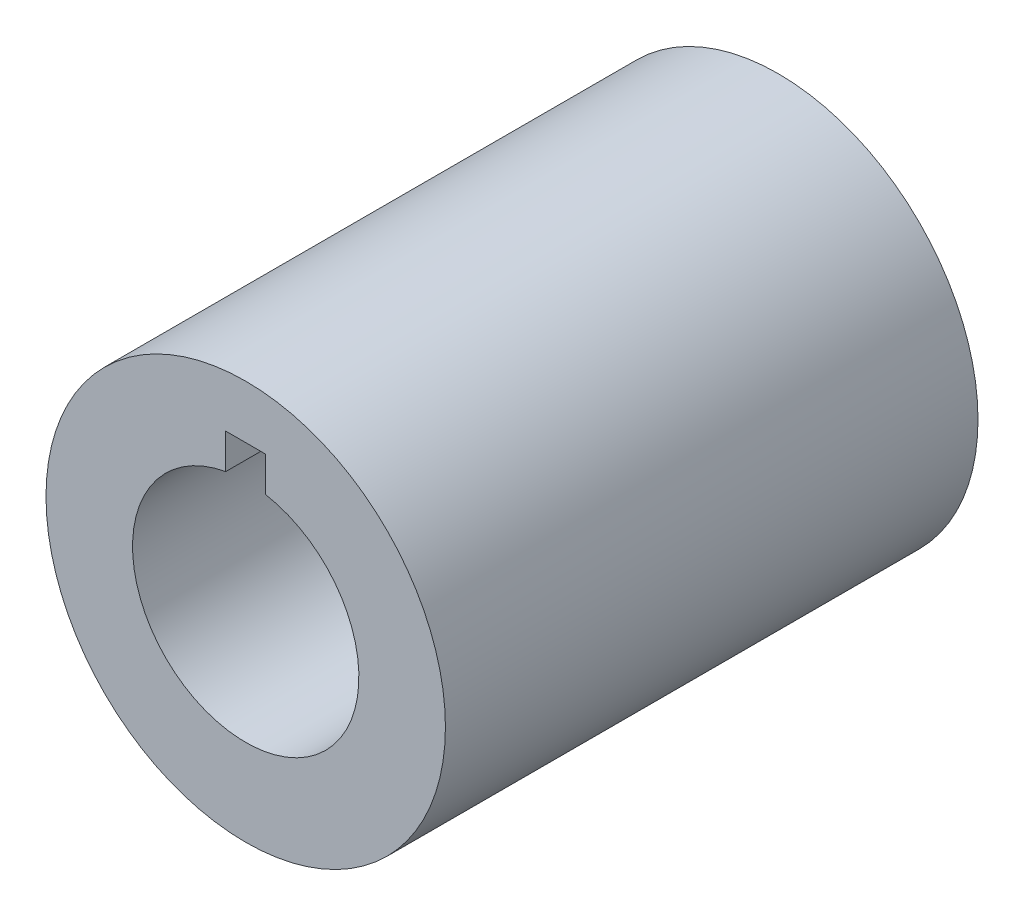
from build123d import *

# Parameters (mm, degrees)
SKETCH2_R           = 15
BOSS_EXTRUDE1_DEPTH = 40


with BuildPart() as part:
    # Sketch2 → Boss-Extrude1 (new body)
    with BuildSketch(Plane.XY):
        Circle(SKETCH2_R)
        with BuildLine():
            Line((-1.5, 8.366600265), (-1.5, 11))
            Line((-1.5, 11), (1.5, 11))
            Line((1.5, 11), (1.5, 8.366600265))
            ThreePointArc((1.5, 8.366600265), (0, -8.5), (-1.5, 8.366600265))
        make_face(mode=Mode.SUBTRACT)
    extrude(amount=BOSS_EXTRUDE1_DEPTH)


solid = part.part
